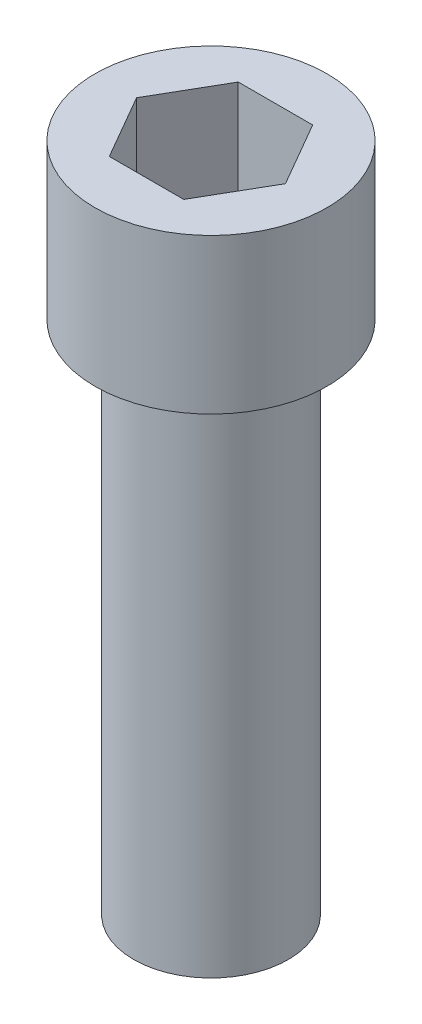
from build123d import *

# Parameters (mm, degrees)
SKETCH1_R           = 9.525
BOSS_EXTRUDE1_DEPTH = 63.5
SKETCH1_3_R         = 14.2875
BOSS_EXTRUDE2_DEPTH = 19.05
CUT_EXTRUDE1_DEPTH  = 12.7


with BuildPart() as part:
    # Sketch1 → Boss-Extrude1 (new body)
    with BuildSketch(Plane(origin=(0, 0, 0), x_dir=(1, 0, 0), z_dir=(0, 1, 0))):
        with Locations(Location((0, 0, 0), (0, 0, 270))):
            Circle(SKETCH1_R)
    extrude(amount=-BOSS_EXTRUDE1_DEPTH)

    # Sketch1_3 → Boss-Extrude2 (add)
    with BuildSketch(Plane(origin=(0, 0, 0), x_dir=(1, 0, 0), z_dir=(0, 1, 0))):
        with Locations(Location((0, 0, 0), (0, 0, 90))):
            Circle(SKETCH1_3_R)
    extrude(amount=BOSS_EXTRUDE2_DEPTH)

    # Sketch2 → Cut-Extrude1 (cut)
    with BuildSketch(Plane(origin=(0, 19.05, 0), x_dir=(1, 0, 0), z_dir=(0, 1, 0))):
        Polygon((9.165435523, 0), (4.582717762, 7.9375), (-4.582717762, 7.9375), (-9.165435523, 0), (-4.582717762, -7.9375), (4.582717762, -7.9375), align=None)
    extrude(amount=-CUT_EXTRUDE1_DEPTH, mode=Mode.SUBTRACT)


solid = part.part
